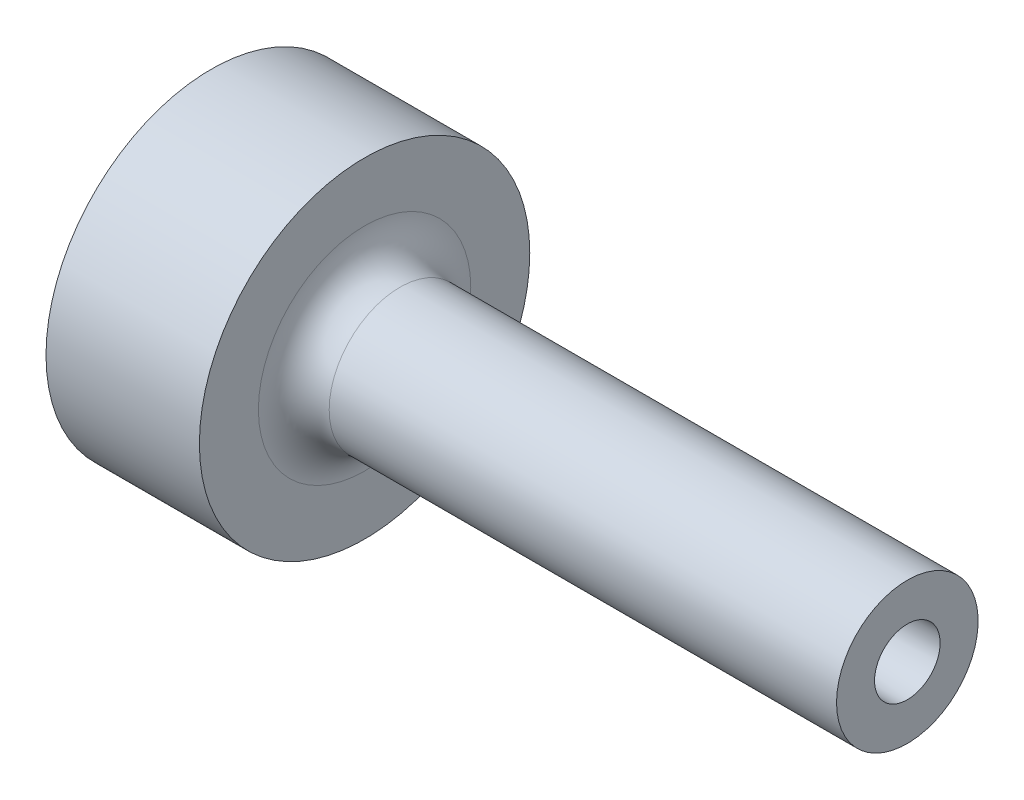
ISO-10303-21;
HEADER;
FILE_DESCRIPTION(('STEP AP214'),'2;1');
FILE_NAME('part.step','',(''),(''),'','','');
FILE_SCHEMA(('AUTOMOTIVE_DESIGN { 1 0 10303 214 1 1 1 1 }'));
ENDSEC;
DATA;
#1=APPLICATION_CONTEXT('core data for automotive mechanical design processes');
#2=APPLICATION_PROTOCOL_DEFINITION('international standard','automotive_design',2000,#1);
#3=PRODUCT_CONTEXT('',#1,'mechanical');
#4=PRODUCT('Part','Part','',(#3));
#5=PRODUCT_RELATED_PRODUCT_CATEGORY('part','',(#4));
#6=PRODUCT_DEFINITION_FORMATION('','',#4);
#7=PRODUCT_DEFINITION_CONTEXT('part definition',#1,'design');
#8=PRODUCT_DEFINITION('design','',#6,#7);
#9=PRODUCT_DEFINITION_SHAPE('','',#8);
#10=(LENGTH_UNIT() NAMED_UNIT(*) SI_UNIT(.MILLI.,.METRE.));
#11=(NAMED_UNIT(*) PLANE_ANGLE_UNIT() SI_UNIT($,.RADIAN.));
#12=(NAMED_UNIT(*) SI_UNIT($,.STERADIAN.) SOLID_ANGLE_UNIT());
#13=UNCERTAINTY_MEASURE_WITH_UNIT(LENGTH_MEASURE(1.E-05),#10,'distance_accuracy_value','');
#14=(GEOMETRIC_REPRESENTATION_CONTEXT(3) GLOBAL_UNCERTAINTY_ASSIGNED_CONTEXT((#13)) GLOBAL_UNIT_ASSIGNED_CONTEXT((#10,
#11,#12)) REPRESENTATION_CONTEXT('',''));
#15=CARTESIAN_POINT('',(0.,0.,0.));
#16=DIRECTION('',(0.,0.,1.));
#17=DIRECTION('',(1.,0.,0.));
#18=AXIS2_PLACEMENT_3D('',#15,#16,#17);
#19=CARTESIAN_POINT('',(0.,0.,0.));
#20=DIRECTION('',(-1.,0.,0.));
#21=DIRECTION('',(0.,0.,1.));
#22=AXIS2_PLACEMENT_3D('',#19,#20,#21);
#23=CYLINDRICAL_SURFACE('',#22,14.);
#24=CARTESIAN_POINT('',(13.,0.,0.));
#25=DIRECTION('',(-1.,0.,0.));
#26=DIRECTION('',(0.,0.,1.));
#27=AXIS2_PLACEMENT_3D('',#24,#25,#26);
#28=CIRCLE('',#27,14.);
#29=CARTESIAN_POINT('',(13.,0.,14.));
#30=VERTEX_POINT('',#29);
#31=EDGE_CURVE('E89',#30,#30,#28,.T.);
#32=ORIENTED_EDGE('',*,*,#31,.T.);
#33=EDGE_LOOP('',(#32));
#34=FACE_BOUND('',#33,.T.);
#35=CARTESIAN_POINT('',(0.,0.,0.));
#36=DIRECTION('',(-1.,0.,0.));
#37=DIRECTION('',(0.,0.,1.));
#38=AXIS2_PLACEMENT_3D('',#35,#36,#37);
#39=CIRCLE('',#38,14.);
#40=CARTESIAN_POINT('',(0.,0.,14.));
#41=VERTEX_POINT('',#40);
#42=EDGE_CURVE('E84',#41,#41,#39,.T.);
#43=ORIENTED_EDGE('',*,*,#42,.F.);
#44=EDGE_LOOP('',(#43));
#45=FACE_BOUND('',#44,.T.);
#46=CARTESIAN_POINT('',(6.5,-13.856406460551,-2.));
#47=CARTESIAN_POINT('',(6.61172417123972,-13.8564082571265,-1.99999534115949));
#48=CARTESIAN_POINT('',(6.72351471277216,-13.8577723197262,-1.99060664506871));
#49=CARTESIAN_POINT('',(6.9439746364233,-13.8630779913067,-1.95330740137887));
#50=CARTESIAN_POINT('',(7.05264079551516,-13.8670221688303,-1.92537839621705));
#51=CARTESIAN_POINT('',(7.26362870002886,-13.8770324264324,-1.85184738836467));
#52=CARTESIAN_POINT('',(7.36595507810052,-13.8830969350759,-1.80625847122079));
#53=CARTESIAN_POINT('',(7.56148972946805,-13.8966626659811,-1.69873175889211));
#54=CARTESIAN_POINT('',(7.65469934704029,-13.9041636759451,-1.63679637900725));
#55=CARTESIAN_POINT('',(7.83004829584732,-13.9198182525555,-1.49785346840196));
#56=CARTESIAN_POINT('',(7.91211171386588,-13.9279757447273,-1.42075056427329));
#57=CARTESIAN_POINT('',(8.06218155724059,-13.9439890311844,-1.25386707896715));
#58=CARTESIAN_POINT('',(8.13018723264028,-13.9518448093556,-1.16408582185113));
#59=CARTESIAN_POINT('',(8.25048909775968,-13.9664103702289,-0.973910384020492));
#60=CARTESIAN_POINT('',(8.30271571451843,-13.9731150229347,-0.873471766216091));
#61=CARTESIAN_POINT('',(8.38953073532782,-13.9845795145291,-0.665136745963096));
#62=CARTESIAN_POINT('',(8.4241199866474,-13.9893394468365,-0.557240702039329));
#63=CARTESIAN_POINT('',(8.47444920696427,-13.9963505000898,-0.337834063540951));
#64=CARTESIAN_POINT('',(8.49031606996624,-13.9986185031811,-0.226353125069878));
#65=CARTESIAN_POINT('',(8.5031438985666,-14.0004479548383,-0.00228956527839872));
#66=CARTESIAN_POINT('',(8.50010582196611,-14.0000095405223,0.110292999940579));
#67=CARTESIAN_POINT('',(8.47531062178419,-13.9964890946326,0.33249899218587));
#68=CARTESIAN_POINT('',(8.45369000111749,-13.9934263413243,0.442137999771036));
#69=CARTESIAN_POINT('',(8.39255744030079,-13.9850228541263,0.656215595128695));
#70=CARTESIAN_POINT('',(8.3530450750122,-13.9796820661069,0.760654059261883));
#71=CARTESIAN_POINT('',(8.25710925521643,-13.9672894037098,0.961781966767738));
#72=CARTESIAN_POINT('',(8.20062784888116,-13.9602316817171,1.05844339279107));
#73=CARTESIAN_POINT('',(8.07239950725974,-13.9451926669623,1.24096782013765));
#74=CARTESIAN_POINT('',(8.00065165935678,-13.9372113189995,1.32683017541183));
#75=CARTESIAN_POINT('',(7.843165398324,-13.921132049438,1.48612299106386));
#76=CARTESIAN_POINT('',(7.75730786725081,-13.9130337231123,1.55943569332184));
#77=CARTESIAN_POINT('',(7.57444547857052,-13.8977029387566,1.69062989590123));
#78=CARTESIAN_POINT('',(7.47744056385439,-13.890470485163,1.74851131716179));
#79=CARTESIAN_POINT('',(7.27491971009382,-13.8776905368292,1.84721301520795));
#80=CARTESIAN_POINT('',(7.1693981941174,-13.8721441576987,1.88802200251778));
#81=CARTESIAN_POINT('',(6.95290242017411,-13.8633846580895,1.9513062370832));
#82=CARTESIAN_POINT('',(6.84192850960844,-13.8601713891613,1.97378265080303));
#83=CARTESIAN_POINT('',(6.61872346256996,-13.8564698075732,1.99960390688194));
#84=CARTESIAN_POINT('',(6.50651197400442,-13.8559577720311,2.00311531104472));
#85=CARTESIAN_POINT('',(6.28310219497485,-13.8576537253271,1.9913480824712));
#86=CARTESIAN_POINT('',(6.17190387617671,-13.8598616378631,1.9760699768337));
#87=CARTESIAN_POINT('',(5.95418781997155,-13.8667269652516,1.92729837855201));
#88=CARTESIAN_POINT('',(5.84765127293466,-13.8713733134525,1.8938871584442));
#89=CARTESIAN_POINT('',(5.6416912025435,-13.8825829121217,1.80988306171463));
#90=CARTESIAN_POINT('',(5.54226800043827,-13.8891462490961,1.75928940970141));
#91=CARTESIAN_POINT('',(5.35260812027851,-13.9035064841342,1.64195360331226));
#92=CARTESIAN_POINT('',(5.26243903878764,-13.911311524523,1.57510320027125));
#93=CARTESIAN_POINT('',(5.09454027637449,-13.9272509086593,1.42730277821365));
#94=CARTESIAN_POINT('',(5.01681123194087,-13.9353852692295,1.34635203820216));
#95=CARTESIAN_POINT('',(4.8754047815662,-13.9511405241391,1.17191708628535));
#96=CARTESIAN_POINT('',(4.81183747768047,-13.9587570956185,1.07834317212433));
#97=CARTESIAN_POINT('',(4.70132443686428,-13.972552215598,0.881748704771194));
#98=CARTESIAN_POINT('',(4.65437828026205,-13.9787308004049,0.778728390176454));
#99=CARTESIAN_POINT('',(4.57861788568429,-13.9889347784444,0.566515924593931));
#100=CARTESIAN_POINT('',(4.54974241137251,-13.9929674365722,0.457345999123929));
#101=CARTESIAN_POINT('',(4.51074453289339,-13.9984555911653,0.235645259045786));
#102=CARTESIAN_POINT('',(4.50062101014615,-13.9999112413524,0.123114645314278));
#103=CARTESIAN_POINT('',(4.49943976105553,-14.0000800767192,-0.101043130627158));
#104=CARTESIAN_POINT('',(4.50821318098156,-13.998817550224,-0.212669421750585));
#105=CARTESIAN_POINT('',(4.54421615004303,-13.9937406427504,-0.432842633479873));
#106=CARTESIAN_POINT('',(4.57144565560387,-13.989926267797,-0.541389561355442));
#107=CARTESIAN_POINT('',(4.6435299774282,-13.9801722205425,-0.752283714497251));
#108=CARTESIAN_POINT('',(4.68837418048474,-13.9742338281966,-0.854634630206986));
#109=CARTESIAN_POINT('',(4.79439714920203,-13.960885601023,-1.05038570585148));
#110=CARTESIAN_POINT('',(4.8555763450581,-13.9534757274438,-1.14378562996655));
#111=CARTESIAN_POINT('',(4.99314771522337,-13.9379304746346,-1.31984194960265));
#112=CARTESIAN_POINT('',(5.06966490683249,-13.9297894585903,-1.40240016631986));
#113=CARTESIAN_POINT('',(5.2354775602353,-13.9137422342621,-1.55356716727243));
#114=CARTESIAN_POINT('',(5.32477602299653,-13.9058360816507,-1.6221726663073));
#115=CARTESIAN_POINT('',(5.51414543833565,-13.8911108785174,-1.74379523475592));
#116=CARTESIAN_POINT('',(5.61426869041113,-13.8842975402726,-1.79673154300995));
#117=CARTESIAN_POINT('',(5.82203229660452,-13.8725962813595,-1.88495902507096));
#118=CARTESIAN_POINT('',(5.92966459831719,-13.8677063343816,-1.92026877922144));
#119=CARTESIAN_POINT('',(6.11483642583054,-13.8615529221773,-1.96409255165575));
#120=CARTESIAN_POINT('',(6.19122433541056,-13.859633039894,-1.97753762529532));
#121=CARTESIAN_POINT('',(6.34506419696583,-13.857059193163,-1.99549291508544));
#122=CARTESIAN_POINT('',(6.42251613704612,-13.8564052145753,-2.00000323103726));
#123=CARTESIAN_POINT('',(6.5,-13.856406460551,-2.));
#124=B_SPLINE_CURVE_WITH_KNOTS('',3,(#46,#47,#48,#49,#50,#51,#52,#53,#54,#55,#56,#57,#58,#59,
#60,#61,#62,#63,#64,#65,#66,#67,#68,#69,#70,#71,#72,#73,#74,#75,#76,#77,#78,#79,#80,#81,#82,#83,
#84,#85,#86,#87,#88,#89,#90,#91,#92,#93,#94,#95,#96,#97,#98,#99,#100,#101,#102,#103,#104,#105,
#106,#107,#108,#109,#110,#111,#112,#113,#114,#115,#116,#117,#118,#119,#120,#121,#122,#123),
.UNSPECIFIED.,.T.,.F.,(4,2,2,2,2,2,2,2,2,2,2,2,2,2,2,2,2,2,2,2,2,2,2,2,2,2,2,2,2,2,2,2,2,2,2,2,
2,2,4),(0.,0.334889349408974,0.670112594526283,1.00508792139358,1.34001378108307,
1.6771171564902,2.01423851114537,2.35282530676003,2.6913958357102,3.02765822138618,
3.36390357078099,3.69769984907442,4.03150405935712,4.36646147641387,4.70143892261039,
5.03940517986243,5.37737316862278,5.7155642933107,6.05373389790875,6.3889286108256,
6.72411392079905,7.05779100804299,7.39148315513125,7.72746121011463,8.06345644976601,
8.40197921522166,8.74049343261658,9.07785422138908,9.41519488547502,9.74953375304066,
10.083871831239,10.4180087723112,10.7521545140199,11.0891434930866,11.426211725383,
11.7649881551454,12.103406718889,12.3356645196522,12.5679197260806),.UNSPECIFIED.);
#125=CARTESIAN_POINT('',(6.5,-13.856406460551,-2.));
#126=VERTEX_POINT('',#125);
#127=EDGE_CURVE('E10',#126,#126,#124,.T.);
#128=ORIENTED_EDGE('',*,*,#127,.F.);
#129=EDGE_LOOP('',(#128));
#130=FACE_BOUND('',#129,.T.);
#131=ADVANCED_FACE('F16',(#34,#45,#130),#23,.T.);
#132=CARTESIAN_POINT('',(0.,0.,0.));
#133=DIRECTION('',(1.,0.,0.));
#134=DIRECTION('',(0.,0.,-1.));
#135=AXIS2_PLACEMENT_3D('',#132,#133,#134);
#136=CONICAL_SURFACE('',#135,1.75,0.0174532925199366);
#137=CARTESIAN_POINT('',(59.,0.,0.));
#138=DIRECTION('',(-1.,0.,0.));
#139=DIRECTION('',(0.,0.,1.));
#140=AXIS2_PLACEMENT_3D('',#137,#138,#139);
#141=CIRCLE('',#140,2.77984883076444);
#142=CARTESIAN_POINT('',(59.,0.,2.77984883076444));
#143=VERTEX_POINT('',#142);
#144=EDGE_CURVE('E81',#143,#143,#141,.T.);
#145=ORIENTED_EDGE('',*,*,#144,.F.);
#146=EDGE_LOOP('',(#145));
#147=FACE_BOUND('',#146,.T.);
#148=CARTESIAN_POINT('',(1.08679639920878,0.,0.));
#149=DIRECTION('',(-1.,0.,0.));
#150=DIRECTION('',(0.,0.,1.));
#151=AXIS2_PLACEMENT_3D('',#148,#149,#150);
#152=CIRCLE('',#151,1.76897010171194);
#153=CARTESIAN_POINT('',(1.08679639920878,0.,1.76897010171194));
#154=VERTEX_POINT('',#153);
#155=EDGE_CURVE('E94',#154,#154,#152,.F.);
#156=ORIENTED_EDGE('',*,*,#155,.F.);
#157=EDGE_LOOP('',(#156));
#158=FACE_BOUND('',#157,.T.);
#159=ADVANCED_FACE('F45',(#147,#158),#136,.F.);
#160=CARTESIAN_POINT('',(16.,0.,0.));
#161=DIRECTION('',(-1.,0.,0.));
#162=DIRECTION('',(0.,0.,1.));
#163=AXIS2_PLACEMENT_3D('',#160,#161,#162);
#164=TOROIDAL_SURFACE('',#163,9.,3.);
#165=CARTESIAN_POINT('',(13.,0.,0.));
#166=DIRECTION('',(-1.,0.,0.));
#167=DIRECTION('',(0.,0.,1.));
#168=AXIS2_PLACEMENT_3D('',#165,#166,#167);
#169=CIRCLE('',#168,9.);
#170=CARTESIAN_POINT('',(13.,0.,9.));
#171=VERTEX_POINT('',#170);
#172=EDGE_CURVE('E91',#171,#171,#169,.T.);
#173=ORIENTED_EDGE('',*,*,#172,.F.);
#174=EDGE_LOOP('',(#173));
#175=FACE_BOUND('',#174,.T.);
#176=CARTESIAN_POINT('',(16.,0.,0.));
#177=DIRECTION('',(-1.,0.,0.));
#178=DIRECTION('',(0.,0.,1.));
#179=AXIS2_PLACEMENT_3D('',#176,#177,#178);
#180=CIRCLE('',#179,6.);
#181=CARTESIAN_POINT('',(16.,0.,6.));
#182=VERTEX_POINT('',#181);
#183=EDGE_CURVE('E28',#182,#182,#180,.T.);
#184=ORIENTED_EDGE('',*,*,#183,.T.);
#185=EDGE_LOOP('',(#184));
#186=FACE_BOUND('',#185,.T.);
#187=ADVANCED_FACE('F18',(#175,#186),#164,.F.);
#188=CARTESIAN_POINT('',(0.,0.,0.));
#189=DIRECTION('',(-1.,0.,0.));
#190=DIRECTION('',(0.,0.,1.));
#191=AXIS2_PLACEMENT_3D('',#188,#189,#190);
#192=CYLINDRICAL_SURFACE('',#191,6.);
#193=ORIENTED_EDGE('',*,*,#183,.F.);
#194=EDGE_LOOP('',(#193));
#195=FACE_BOUND('',#194,.T.);
#196=CARTESIAN_POINT('',(59.,0.,0.));
#197=DIRECTION('',(-1.,0.,0.));
#198=DIRECTION('',(0.,0.,1.));
#199=AXIS2_PLACEMENT_3D('',#196,#197,#198);
#200=CIRCLE('',#199,6.);
#201=CARTESIAN_POINT('',(59.,0.,6.));
#202=VERTEX_POINT('',#201);
#203=EDGE_CURVE('E80',#202,#202,#200,.T.);
#204=ORIENTED_EDGE('',*,*,#203,.T.);
#205=EDGE_LOOP('',(#204));
#206=FACE_BOUND('',#205,.T.);
#207=ADVANCED_FACE('F66',(#195,#206),#192,.T.);
#208=CARTESIAN_POINT('',(59.,6.,0.));
#209=DIRECTION('',(-1.,0.,0.));
#210=DIRECTION('',(0.,0.,1.));
#211=AXIS2_PLACEMENT_3D('',#208,#209,#210);
#212=PLANE('',#211);
#213=ORIENTED_EDGE('',*,*,#203,.F.);
#214=EDGE_LOOP('',(#213));
#215=FACE_BOUND('',#214,.T.);
#216=ORIENTED_EDGE('',*,*,#144,.T.);
#217=EDGE_LOOP('',(#216));
#218=FACE_BOUND('',#217,.T.);
#219=ADVANCED_FACE('F62',(#215,#218),#212,.F.);
#220=CARTESIAN_POINT('',(0.,1.75,0.));
#221=DIRECTION('',(1.,0.,0.));
#222=DIRECTION('',(0.,0.,-1.));
#223=AXIS2_PLACEMENT_3D('',#220,#221,#222);
#224=PLANE('',#223);
#225=CARTESIAN_POINT('',(0.,0.,0.));
#226=DIRECTION('',(-1.,0.,0.));
#227=DIRECTION('',(0.,0.,1.));
#228=AXIS2_PLACEMENT_3D('',#225,#226,#227);
#229=CIRCLE('',#228,5.);
#230=CARTESIAN_POINT('',(0.,0.,5.));
#231=VERTEX_POINT('',#230);
#232=EDGE_CURVE('E97',#231,#231,#229,.T.);
#233=ORIENTED_EDGE('',*,*,#232,.F.);
#234=EDGE_LOOP('',(#233));
#235=FACE_BOUND('',#234,.T.);
#236=ORIENTED_EDGE('',*,*,#42,.T.);
#237=EDGE_LOOP('',(#236));
#238=FACE_BOUND('',#237,.T.);
#239=ADVANCED_FACE('F60',(#235,#238),#224,.F.);
#240=CARTESIAN_POINT('',(13.,14.,0.));
#241=DIRECTION('',(-1.,0.,0.));
#242=DIRECTION('',(0.,0.,1.));
#243=AXIS2_PLACEMENT_3D('',#240,#241,#242);
#244=PLANE('',#243);
#245=ORIENTED_EDGE('',*,*,#31,.F.);
#246=EDGE_LOOP('',(#245));
#247=FACE_BOUND('',#246,.T.);
#248=ORIENTED_EDGE('',*,*,#172,.T.);
#249=EDGE_LOOP('',(#248));
#250=FACE_BOUND('',#249,.T.);
#251=ADVANCED_FACE('F58',(#247,#250),#244,.F.);
#252=CARTESIAN_POINT('',(-37.3349076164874,0.,0.));
#253=DIRECTION('',(-1.,0.,0.));
#254=DIRECTION('',(0.,0.,1.));
#255=AXIS2_PLACEMENT_3D('',#252,#253,#254);
#256=DEGENERATE_TOROIDAL_SURFACE('',#255,9.35634609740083,40.,.F.);
#257=ORIENTED_EDGE('',*,*,#232,.T.);
#258=EDGE_LOOP('',(#257));
#259=FACE_BOUND('',#258,.T.);
#260=ORIENTED_EDGE('',*,*,#155,.T.);
#261=EDGE_LOOP('',(#260));
#262=FACE_BOUND('',#261,.T.);
#263=ADVANCED_FACE('F41',(#259,#262),#256,.T.);
#264=CARTESIAN_POINT('',(6.5,-14.,0.));
#265=DIRECTION('',(0.,-1.,0.));
#266=DIRECTION('',(0.,0.,-1.));
#267=AXIS2_PLACEMENT_3D('',#264,#265,#266);
#268=CYLINDRICAL_SURFACE('',#267,2.);
#269=CARTESIAN_POINT('',(6.5,-8.,0.));
#270=DIRECTION('',(0.,-1.,0.));
#271=DIRECTION('',(0.,0.,-1.));
#272=AXIS2_PLACEMENT_3D('',#269,#270,#271);
#273=CIRCLE('',#272,2.);
#274=CARTESIAN_POINT('',(6.5,-8.,-2.));
#275=VERTEX_POINT('',#274);
#276=EDGE_CURVE('E100',#275,#275,#273,.T.);
#277=ORIENTED_EDGE('',*,*,#276,.F.);
#278=EDGE_LOOP('',(#277));
#279=FACE_BOUND('',#278,.T.);
#280=ORIENTED_EDGE('',*,*,#127,.T.);
#281=EDGE_LOOP('',(#280));
#282=FACE_BOUND('',#281,.T.);
#283=ADVANCED_FACE('F33',(#279,#282),#268,.F.);
#284=CARTESIAN_POINT('',(6.5,-6.84529946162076,0.));
#285=DIRECTION('',(0.,-1.,0.));
#286=DIRECTION('',(0.,0.,-1.));
#287=AXIS2_PLACEMENT_3D('',#284,#285,#286);
#288=CONICAL_SURFACE('',#287,0.,1.0471975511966);
#289=ORIENTED_EDGE('',*,*,#276,.T.);
#290=EDGE_LOOP('',(#289));
#291=FACE_BOUND('',#290,.T.);
#292=CARTESIAN_POINT('',(6.5,-6.84529946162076,0.));
#293=VERTEX_POINT('',#292);
#294=VERTEX_LOOP('',#293);
#295=FACE_BOUND('',#294,.T.);
#296=ADVANCED_FACE('F31',(#291,#295),#288,.F.);
#297=CLOSED_SHELL('',(#131,#159,#187,#207,#219,#239,#251,#263,#283,#296));
#298=MANIFOLD_SOLID_BREP('B1',#297);
#299=ADVANCED_BREP_SHAPE_REPRESENTATION('',(#18,#298),#14);
#300=SHAPE_DEFINITION_REPRESENTATION(#9,#299);
ENDSEC;
END-ISO-10303-21;
